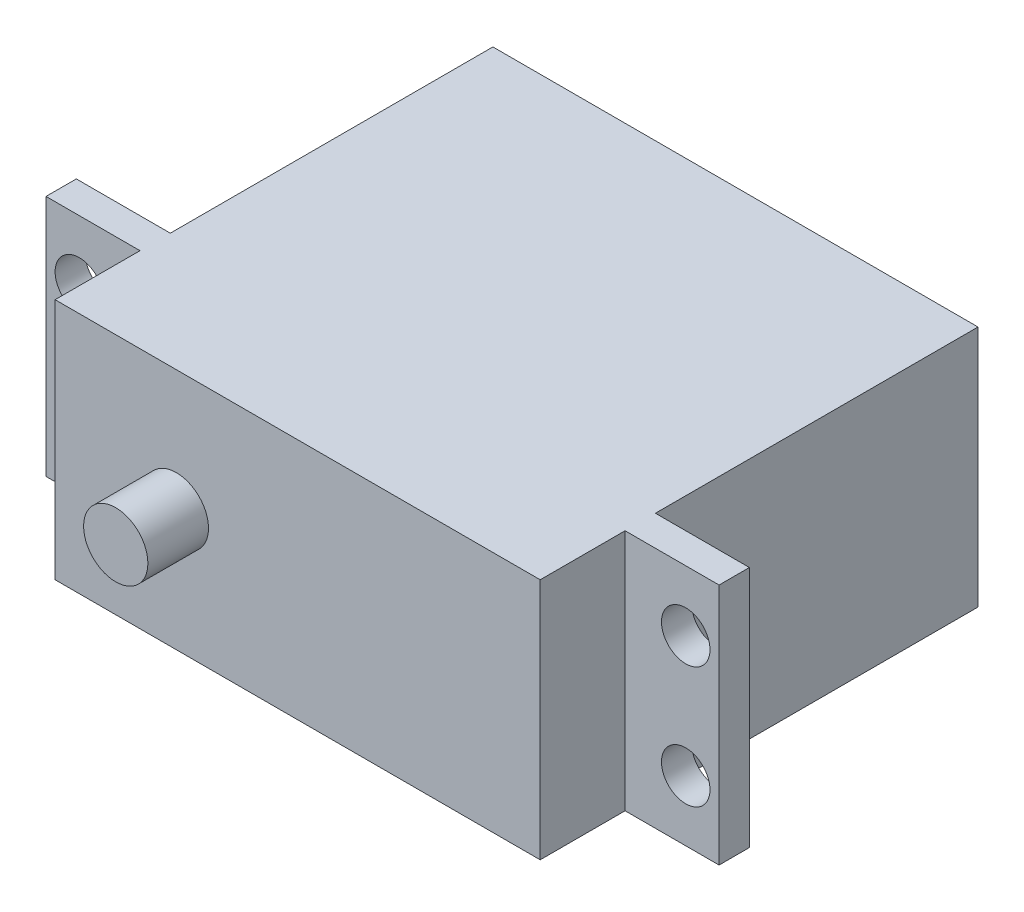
ISO-10303-21;
HEADER;
FILE_DESCRIPTION(('STEP AP214'),'2;1');
FILE_NAME('part.step','',(''),(''),'','','');
FILE_SCHEMA(('AUTOMOTIVE_DESIGN { 1 0 10303 214 1 1 1 1 }'));
ENDSEC;
DATA;
#1=APPLICATION_CONTEXT('core data for automotive mechanical design processes');
#2=APPLICATION_PROTOCOL_DEFINITION('international standard','automotive_design',2000,#1);
#3=PRODUCT_CONTEXT('',#1,'mechanical');
#4=PRODUCT('Part','Part','',(#3));
#5=PRODUCT_RELATED_PRODUCT_CATEGORY('part','',(#4));
#6=PRODUCT_DEFINITION_FORMATION('','',#4);
#7=PRODUCT_DEFINITION_CONTEXT('part definition',#1,'design');
#8=PRODUCT_DEFINITION('design','',#6,#7);
#9=PRODUCT_DEFINITION_SHAPE('','',#8);
#10=(LENGTH_UNIT() NAMED_UNIT(*) SI_UNIT(.MILLI.,.METRE.));
#11=(NAMED_UNIT(*) PLANE_ANGLE_UNIT() SI_UNIT($,.RADIAN.));
#12=(NAMED_UNIT(*) SI_UNIT($,.STERADIAN.) SOLID_ANGLE_UNIT());
#13=UNCERTAINTY_MEASURE_WITH_UNIT(LENGTH_MEASURE(1.E-05),#10,'distance_accuracy_value','');
#14=(GEOMETRIC_REPRESENTATION_CONTEXT(3) GLOBAL_UNCERTAINTY_ASSIGNED_CONTEXT((#13)) GLOBAL_UNIT_ASSIGNED_CONTEXT((#10,
#11,#12)) REPRESENTATION_CONTEXT('',''));
#15=CARTESIAN_POINT('',(0.,0.,0.));
#16=DIRECTION('',(0.,0.,1.));
#17=DIRECTION('',(1.,0.,0.));
#18=AXIS2_PLACEMENT_3D('',#15,#16,#17);
#19=CARTESIAN_POINT('',(0.,0.,36.1));
#20=DIRECTION('',(0.,0.,-1.));
#21=DIRECTION('',(-1.,0.,0.));
#22=AXIS2_PLACEMENT_3D('',#19,#20,#21);
#23=PLANE('',#22);
#24=DIRECTION('',(0.,-1.,0.));
#25=VECTOR('',#24,1.);
#26=CARTESIAN_POINT('',(0.,0.,36.1));
#27=LINE('',#26,#25);
#28=CARTESIAN_POINT('',(0.,20.,36.1));
#29=VERTEX_POINT('',#28);
#30=CARTESIAN_POINT('',(0.,0.,36.1));
#31=VERTEX_POINT('',#30);
#32=EDGE_CURVE('E187',#29,#31,#27,.T.);
#33=ORIENTED_EDGE('',*,*,#32,.T.);
#34=DIRECTION('',(1.,0.,0.));
#35=VECTOR('',#34,1.);
#36=CARTESIAN_POINT('',(0.,0.,36.1));
#37=LINE('',#36,#35);
#38=CARTESIAN_POINT('',(40.,0.,36.1));
#39=VERTEX_POINT('',#38);
#40=EDGE_CURVE('E190',#31,#39,#37,.T.);
#41=ORIENTED_EDGE('',*,*,#40,.T.);
#42=DIRECTION('',(0.,1.,0.));
#43=VECTOR('',#42,1.);
#44=CARTESIAN_POINT('',(40.,0.,36.1));
#45=LINE('',#44,#43);
#46=CARTESIAN_POINT('',(40.,20.,36.1));
#47=VERTEX_POINT('',#46);
#48=EDGE_CURVE('E193',#39,#47,#45,.T.);
#49=ORIENTED_EDGE('',*,*,#48,.T.);
#50=DIRECTION('',(-1.,0.,0.));
#51=VECTOR('',#50,1.);
#52=CARTESIAN_POINT('',(0.,20.,36.1));
#53=LINE('',#52,#51);
#54=EDGE_CURVE('E195',#47,#29,#53,.T.);
#55=ORIENTED_EDGE('',*,*,#54,.T.);
#56=EDGE_LOOP('',(#33,#41,#49,#55));
#57=FACE_BOUND('',#56,.T.);
#58=CARTESIAN_POINT('',(10.,10.,36.1));
#59=DIRECTION('',(0.,0.,-1.));
#60=DIRECTION('',(-1.,0.,0.));
#61=AXIS2_PLACEMENT_3D('',#58,#59,#60);
#62=CIRCLE('',#61,2.65);
#63=CARTESIAN_POINT('',(7.35,10.,36.1));
#64=VERTEX_POINT('',#63);
#65=EDGE_CURVE('E11',#64,#64,#62,.F.);
#66=ORIENTED_EDGE('',*,*,#65,.F.);
#67=EDGE_LOOP('',(#66));
#68=FACE_BOUND('',#67,.T.);
#69=ADVANCED_FACE('F35',(#57,#68),#23,.F.);
#70=CARTESIAN_POINT('',(0.,0.,36.1));
#71=DIRECTION('',(1.,0.,0.));
#72=DIRECTION('',(0.,0.,-1.));
#73=AXIS2_PLACEMENT_3D('',#70,#71,#72);
#74=PLANE('',#73);
#75=DIRECTION('',(0.,0.,-1.));
#76=VECTOR('',#75,1.);
#77=CARTESIAN_POINT('',(0.,20.,36.1));
#78=LINE('',#77,#76);
#79=CARTESIAN_POINT('',(0.,20.,29.1));
#80=VERTEX_POINT('',#79);
#81=EDGE_CURVE('E208',#29,#80,#78,.T.);
#82=ORIENTED_EDGE('',*,*,#81,.T.);
#83=DIRECTION('',(0.,-1.,0.));
#84=VECTOR('',#83,1.);
#85=CARTESIAN_POINT('',(0.,0.,29.1));
#86=LINE('',#85,#84);
#87=CARTESIAN_POINT('',(0.,0.,29.1));
#88=VERTEX_POINT('',#87);
#89=EDGE_CURVE('E183',#80,#88,#86,.T.);
#90=ORIENTED_EDGE('',*,*,#89,.T.);
#91=DIRECTION('',(0.,0.,-1.));
#92=VECTOR('',#91,1.);
#93=CARTESIAN_POINT('',(0.,0.,36.1));
#94=LINE('',#93,#92);
#95=EDGE_CURVE('E43',#31,#88,#94,.T.);
#96=ORIENTED_EDGE('',*,*,#95,.F.);
#97=ORIENTED_EDGE('',*,*,#32,.F.);
#98=EDGE_LOOP('',(#82,#90,#96,#97));
#99=FACE_BOUND('',#98,.T.);
#100=ADVANCED_FACE('F264',(#99),#74,.F.);
#101=CARTESIAN_POINT('',(40.,0.,36.1));
#102=DIRECTION('',(-1.,0.,0.));
#103=DIRECTION('',(0.,0.,1.));
#104=AXIS2_PLACEMENT_3D('',#101,#102,#103);
#105=PLANE('',#104);
#106=DIRECTION('',(0.,0.,-1.));
#107=VECTOR('',#106,1.);
#108=CARTESIAN_POINT('',(40.,0.,36.1));
#109=LINE('',#108,#107);
#110=CARTESIAN_POINT('',(40.,0.,29.1));
#111=VERTEX_POINT('',#110);
#112=EDGE_CURVE('E58',#39,#111,#109,.T.);
#113=ORIENTED_EDGE('',*,*,#112,.T.);
#114=DIRECTION('',(0.,1.,0.));
#115=VECTOR('',#114,1.);
#116=CARTESIAN_POINT('',(40.,0.,29.1));
#117=LINE('',#116,#115);
#118=CARTESIAN_POINT('',(40.,20.,29.1));
#119=VERTEX_POINT('',#118);
#120=EDGE_CURVE('E131',#111,#119,#117,.T.);
#121=ORIENTED_EDGE('',*,*,#120,.T.);
#122=DIRECTION('',(0.,0.,-1.));
#123=VECTOR('',#122,1.);
#124=CARTESIAN_POINT('',(40.,20.,36.1));
#125=LINE('',#124,#123);
#126=EDGE_CURVE('E212',#47,#119,#125,.T.);
#127=ORIENTED_EDGE('',*,*,#126,.F.);
#128=ORIENTED_EDGE('',*,*,#48,.F.);
#129=EDGE_LOOP('',(#113,#121,#127,#128));
#130=FACE_BOUND('',#129,.T.);
#131=ADVANCED_FACE('F269',(#130),#105,.F.);
#132=CARTESIAN_POINT('',(0.,0.,26.6));
#133=VERTEX_POINT('',#132);
#134=CARTESIAN_POINT('',(0.,0.,0.));
#135=VERTEX_POINT('',#134);
#136=EDGE_CURVE('E217',#133,#135,#94,.T.);
#137=ORIENTED_EDGE('',*,*,#136,.F.);
#138=DIRECTION('',(0.,1.,0.));
#139=VECTOR('',#138,1.);
#140=CARTESIAN_POINT('',(0.,0.,26.6));
#141=LINE('',#140,#139);
#142=CARTESIAN_POINT('',(0.,20.,26.6));
#143=VERTEX_POINT('',#142);
#144=EDGE_CURVE('E179',#133,#143,#141,.T.);
#145=ORIENTED_EDGE('',*,*,#144,.T.);
#146=CARTESIAN_POINT('',(0.,20.,0.));
#147=VERTEX_POINT('',#146);
#148=EDGE_CURVE('E197',#143,#147,#78,.T.);
#149=ORIENTED_EDGE('',*,*,#148,.T.);
#150=DIRECTION('',(0.,-1.,0.));
#151=VECTOR('',#150,1.);
#152=CARTESIAN_POINT('',(0.,0.,0.));
#153=LINE('',#152,#151);
#154=EDGE_CURVE('E186',#147,#135,#153,.T.);
#155=ORIENTED_EDGE('',*,*,#154,.T.);
#156=EDGE_LOOP('',(#137,#145,#149,#155));
#157=FACE_BOUND('',#156,.T.);
#158=ADVANCED_FACE('F37',(#157),#74,.F.);
#159=CARTESIAN_POINT('',(0.,0.,36.1));
#160=DIRECTION('',(0.,1.,0.));
#161=DIRECTION('',(0.,0.,1.));
#162=AXIS2_PLACEMENT_3D('',#159,#160,#161);
#163=PLANE('',#162);
#164=CARTESIAN_POINT('',(40.,0.,26.6));
#165=VERTEX_POINT('',#164);
#166=CARTESIAN_POINT('',(40.,0.,0.));
#167=VERTEX_POINT('',#166);
#168=EDGE_CURVE('E215',#165,#167,#109,.T.);
#169=ORIENTED_EDGE('',*,*,#168,.F.);
#170=DIRECTION('',(1.,0.,0.));
#171=VECTOR('',#170,1.);
#172=CARTESIAN_POINT('',(-7.75,0.,26.6));
#173=LINE('',#172,#171);
#174=CARTESIAN_POINT('',(47.75,0.,26.6));
#175=VERTEX_POINT('',#174);
#176=EDGE_CURVE('E139',#165,#175,#173,.T.);
#177=ORIENTED_EDGE('',*,*,#176,.T.);
#178=DIRECTION('',(0.,0.,-1.));
#179=VECTOR('',#178,1.);
#180=CARTESIAN_POINT('',(47.75,0.,29.1));
#181=LINE('',#180,#179);
#182=CARTESIAN_POINT('',(47.75,0.,29.1));
#183=VERTEX_POINT('',#182);
#184=EDGE_CURVE('E136',#183,#175,#181,.T.);
#185=ORIENTED_EDGE('',*,*,#184,.F.);
#186=DIRECTION('',(1.,0.,0.));
#187=VECTOR('',#186,1.);
#188=CARTESIAN_POINT('',(-7.75,0.,29.1));
#189=LINE('',#188,#187);
#190=EDGE_CURVE('E125',#111,#183,#189,.T.);
#191=ORIENTED_EDGE('',*,*,#190,.F.);
#192=ORIENTED_EDGE('',*,*,#112,.F.);
#193=ORIENTED_EDGE('',*,*,#40,.F.);
#194=ORIENTED_EDGE('',*,*,#95,.T.);
#195=CARTESIAN_POINT('',(-7.75,0.,29.1));
#196=VERTEX_POINT('',#195);
#197=EDGE_CURVE('E132',#196,#88,#189,.T.);
#198=ORIENTED_EDGE('',*,*,#197,.F.);
#199=DIRECTION('',(0.,0.,-1.));
#200=VECTOR('',#199,1.);
#201=CARTESIAN_POINT('',(-7.75,0.,29.1));
#202=LINE('',#201,#200);
#203=CARTESIAN_POINT('',(-7.75,0.,26.6));
#204=VERTEX_POINT('',#203);
#205=EDGE_CURVE('E161',#196,#204,#202,.T.);
#206=ORIENTED_EDGE('',*,*,#205,.T.);
#207=EDGE_CURVE('E50',#204,#133,#173,.T.);
#208=ORIENTED_EDGE('',*,*,#207,.T.);
#209=ORIENTED_EDGE('',*,*,#136,.T.);
#210=DIRECTION('',(1.,0.,0.));
#211=VECTOR('',#210,1.);
#212=CARTESIAN_POINT('',(0.,0.,0.));
#213=LINE('',#212,#211);
#214=EDGE_CURVE('E200',#135,#167,#213,.T.);
#215=ORIENTED_EDGE('',*,*,#214,.T.);
#216=EDGE_LOOP('',(#169,#177,#185,#191,#192,#193,#194,#198,#206,#208,#209,#215));
#217=FACE_BOUND('',#216,.T.);
#218=ADVANCED_FACE('F137',(#217),#163,.F.);
#219=CARTESIAN_POINT('',(40.,20.,26.6));
#220=VERTEX_POINT('',#219);
#221=CARTESIAN_POINT('',(40.,20.,0.));
#222=VERTEX_POINT('',#221);
#223=EDGE_CURVE('E211',#220,#222,#125,.T.);
#224=ORIENTED_EDGE('',*,*,#223,.F.);
#225=DIRECTION('',(0.,-1.,0.));
#226=VECTOR('',#225,1.);
#227=CARTESIAN_POINT('',(40.,0.,26.6));
#228=LINE('',#227,#226);
#229=EDGE_CURVE('E171',#220,#165,#228,.T.);
#230=ORIENTED_EDGE('',*,*,#229,.T.);
#231=ORIENTED_EDGE('',*,*,#168,.T.);
#232=DIRECTION('',(0.,1.,0.));
#233=VECTOR('',#232,1.);
#234=CARTESIAN_POINT('',(40.,0.,0.));
#235=LINE('',#234,#233);
#236=EDGE_CURVE('E203',#167,#222,#235,.T.);
#237=ORIENTED_EDGE('',*,*,#236,.T.);
#238=EDGE_LOOP('',(#224,#230,#231,#237));
#239=FACE_BOUND('',#238,.T.);
#240=ADVANCED_FACE('F280',(#239),#105,.F.);
#241=CARTESIAN_POINT('',(0.,20.,36.1));
#242=DIRECTION('',(0.,-1.,0.));
#243=DIRECTION('',(0.,0.,-1.));
#244=AXIS2_PLACEMENT_3D('',#241,#242,#243);
#245=PLANE('',#244);
#246=ORIENTED_EDGE('',*,*,#148,.F.);
#247=DIRECTION('',(1.,0.,0.));
#248=VECTOR('',#247,1.);
#249=CARTESIAN_POINT('',(-7.75,20.,26.6));
#250=LINE('',#249,#248);
#251=CARTESIAN_POINT('',(-7.75,20.,26.6));
#252=VERTEX_POINT('',#251);
#253=EDGE_CURVE('E173',#252,#143,#250,.T.);
#254=ORIENTED_EDGE('',*,*,#253,.F.);
#255=DIRECTION('',(0.,0.,1.));
#256=VECTOR('',#255,1.);
#257=CARTESIAN_POINT('',(-7.75,20.,29.1));
#258=LINE('',#257,#256);
#259=CARTESIAN_POINT('',(-7.75,20.,29.1));
#260=VERTEX_POINT('',#259);
#261=EDGE_CURVE('E133',#252,#260,#258,.T.);
#262=ORIENTED_EDGE('',*,*,#261,.T.);
#263=DIRECTION('',(1.,0.,0.));
#264=VECTOR('',#263,1.);
#265=CARTESIAN_POINT('',(-7.75,20.,29.1));
#266=LINE('',#265,#264);
#267=EDGE_CURVE('E168',#260,#80,#266,.T.);
#268=ORIENTED_EDGE('',*,*,#267,.T.);
#269=ORIENTED_EDGE('',*,*,#81,.F.);
#270=ORIENTED_EDGE('',*,*,#54,.F.);
#271=ORIENTED_EDGE('',*,*,#126,.T.);
#272=CARTESIAN_POINT('',(47.75,20.,29.1));
#273=VERTEX_POINT('',#272);
#274=EDGE_CURVE('E172',#119,#273,#266,.T.);
#275=ORIENTED_EDGE('',*,*,#274,.T.);
#276=DIRECTION('',(0.,0.,1.));
#277=VECTOR('',#276,1.);
#278=CARTESIAN_POINT('',(47.75,20.,29.1));
#279=LINE('',#278,#277);
#280=CARTESIAN_POINT('',(47.75,20.,26.6));
#281=VERTEX_POINT('',#280);
#282=EDGE_CURVE('E148',#281,#273,#279,.T.);
#283=ORIENTED_EDGE('',*,*,#282,.F.);
#284=EDGE_CURVE('E175',#220,#281,#250,.T.);
#285=ORIENTED_EDGE('',*,*,#284,.F.);
#286=ORIENTED_EDGE('',*,*,#223,.T.);
#287=DIRECTION('',(-1.,0.,0.));
#288=VECTOR('',#287,1.);
#289=CARTESIAN_POINT('',(0.,20.,0.));
#290=LINE('',#289,#288);
#291=EDGE_CURVE('E191',#222,#147,#290,.T.);
#292=ORIENTED_EDGE('',*,*,#291,.T.);
#293=EDGE_LOOP('',(#246,#254,#262,#268,#269,#270,#271,#275,#283,#285,#286,#292));
#294=FACE_BOUND('',#293,.T.);
#295=ADVANCED_FACE('F276',(#294),#245,.F.);
#296=CARTESIAN_POINT('',(0.,0.,0.));
#297=DIRECTION('',(0.,0.,-1.));
#298=DIRECTION('',(-1.,0.,0.));
#299=AXIS2_PLACEMENT_3D('',#296,#297,#298);
#300=PLANE('',#299);
#301=ORIENTED_EDGE('',*,*,#154,.F.);
#302=ORIENTED_EDGE('',*,*,#291,.F.);
#303=ORIENTED_EDGE('',*,*,#236,.F.);
#304=ORIENTED_EDGE('',*,*,#214,.F.);
#305=EDGE_LOOP('',(#301,#302,#303,#304));
#306=FACE_BOUND('',#305,.T.);
#307=ADVANCED_FACE('F273',(#306),#300,.T.);
#308=CARTESIAN_POINT('',(47.75,0.,0.));
#309=DIRECTION('',(1.,0.,0.));
#310=DIRECTION('',(0.,0.,-1.));
#311=AXIS2_PLACEMENT_3D('',#308,#309,#310);
#312=PLANE('',#311);
#313=DIRECTION('',(0.,-1.,0.));
#314=VECTOR('',#313,1.);
#315=CARTESIAN_POINT('',(47.75,20.,29.1));
#316=LINE('',#315,#314);
#317=EDGE_CURVE('E130',#273,#183,#316,.T.);
#318=ORIENTED_EDGE('',*,*,#317,.T.);
#319=ORIENTED_EDGE('',*,*,#184,.T.);
#320=DIRECTION('',(0.,1.,0.));
#321=VECTOR('',#320,1.);
#322=CARTESIAN_POINT('',(47.75,20.,26.6));
#323=LINE('',#322,#321);
#324=EDGE_CURVE('E143',#175,#281,#323,.T.);
#325=ORIENTED_EDGE('',*,*,#324,.T.);
#326=ORIENTED_EDGE('',*,*,#282,.T.);
#327=EDGE_LOOP('',(#318,#319,#325,#326));
#328=FACE_BOUND('',#327,.T.);
#329=ADVANCED_FACE('F146',(#328),#312,.T.);
#330=CARTESIAN_POINT('',(-7.75,20.,26.6));
#331=DIRECTION('',(0.,0.,-1.));
#332=DIRECTION('',(0.,1.,0.));
#333=AXIS2_PLACEMENT_3D('',#330,#331,#332);
#334=PLANE('',#333);
#335=CARTESIAN_POINT('',(45.,5.,26.6));
#336=DIRECTION('',(0.,0.,-1.));
#337=DIRECTION('',(0.,1.,0.));
#338=AXIS2_PLACEMENT_3D('',#335,#336,#337);
#339=CIRCLE('',#338,2.);
#340=CARTESIAN_POINT('',(45.,7.,26.6));
#341=VERTEX_POINT('',#340);
#342=EDGE_CURVE('E241',#341,#341,#339,.T.);
#343=ORIENTED_EDGE('',*,*,#342,.F.);
#344=EDGE_LOOP('',(#343));
#345=FACE_BOUND('',#344,.T.);
#346=CARTESIAN_POINT('',(45.,15.,26.6));
#347=DIRECTION('',(0.,0.,-1.));
#348=DIRECTION('',(0.,1.,0.));
#349=AXIS2_PLACEMENT_3D('',#346,#347,#348);
#350=CIRCLE('',#349,2.);
#351=CARTESIAN_POINT('',(45.,17.,26.6));
#352=VERTEX_POINT('',#351);
#353=EDGE_CURVE('E149',#352,#352,#350,.T.);
#354=ORIENTED_EDGE('',*,*,#353,.F.);
#355=EDGE_LOOP('',(#354));
#356=FACE_BOUND('',#355,.T.);
#357=ORIENTED_EDGE('',*,*,#229,.F.);
#358=ORIENTED_EDGE('',*,*,#284,.T.);
#359=ORIENTED_EDGE('',*,*,#324,.F.);
#360=ORIENTED_EDGE('',*,*,#176,.F.);
#361=EDGE_LOOP('',(#357,#358,#359,#360));
#362=FACE_BOUND('',#361,.T.);
#363=ADVANCED_FACE('F250',(#345,#356,#362),#334,.T.);
#364=CARTESIAN_POINT('',(-7.75,20.,29.1));
#365=DIRECTION('',(0.,0.,1.));
#366=DIRECTION('',(0.,-1.,0.));
#367=AXIS2_PLACEMENT_3D('',#364,#365,#366);
#368=PLANE('',#367);
#369=CARTESIAN_POINT('',(45.,5.,29.1));
#370=DIRECTION('',(0.,0.,1.));
#371=DIRECTION('',(1.,0.,0.));
#372=AXIS2_PLACEMENT_3D('',#369,#370,#371);
#373=CIRCLE('',#372,2.);
#374=CARTESIAN_POINT('',(47.,5.,29.1));
#375=VERTEX_POINT('',#374);
#376=EDGE_CURVE('E222',#375,#375,#373,.T.);
#377=ORIENTED_EDGE('',*,*,#376,.F.);
#378=EDGE_LOOP('',(#377));
#379=FACE_BOUND('',#378,.T.);
#380=CARTESIAN_POINT('',(45.,15.,29.1));
#381=DIRECTION('',(0.,0.,1.));
#382=DIRECTION('',(1.,0.,0.));
#383=AXIS2_PLACEMENT_3D('',#380,#381,#382);
#384=CIRCLE('',#383,2.);
#385=CARTESIAN_POINT('',(47.,15.,29.1));
#386=VERTEX_POINT('',#385);
#387=EDGE_CURVE('E152',#386,#386,#384,.T.);
#388=ORIENTED_EDGE('',*,*,#387,.F.);
#389=EDGE_LOOP('',(#388));
#390=FACE_BOUND('',#389,.T.);
#391=ORIENTED_EDGE('',*,*,#120,.F.);
#392=ORIENTED_EDGE('',*,*,#190,.T.);
#393=ORIENTED_EDGE('',*,*,#317,.F.);
#394=ORIENTED_EDGE('',*,*,#274,.F.);
#395=EDGE_LOOP('',(#391,#392,#393,#394));
#396=FACE_BOUND('',#395,.T.);
#397=ADVANCED_FACE('F127',(#379,#390,#396),#368,.T.);
#398=CARTESIAN_POINT('',(-5.,5.,29.1));
#399=DIRECTION('',(0.,0.,1.));
#400=DIRECTION('',(1.,0.,0.));
#401=AXIS2_PLACEMENT_3D('',#398,#399,#400);
#402=CIRCLE('',#401,2.);
#403=CARTESIAN_POINT('',(-3.,5.,29.1));
#404=VERTEX_POINT('',#403);
#405=EDGE_CURVE('E226',#404,#404,#402,.T.);
#406=ORIENTED_EDGE('',*,*,#405,.F.);
#407=EDGE_LOOP('',(#406));
#408=FACE_BOUND('',#407,.T.);
#409=CARTESIAN_POINT('',(-5.,15.,29.1));
#410=DIRECTION('',(0.,0.,1.));
#411=DIRECTION('',(1.,0.,0.));
#412=AXIS2_PLACEMENT_3D('',#409,#410,#411);
#413=CIRCLE('',#412,2.);
#414=CARTESIAN_POINT('',(-3.,15.,29.1));
#415=VERTEX_POINT('',#414);
#416=EDGE_CURVE('E223',#415,#415,#413,.T.);
#417=ORIENTED_EDGE('',*,*,#416,.F.);
#418=EDGE_LOOP('',(#417));
#419=FACE_BOUND('',#418,.T.);
#420=ORIENTED_EDGE('',*,*,#89,.F.);
#421=ORIENTED_EDGE('',*,*,#267,.F.);
#422=DIRECTION('',(0.,-1.,0.));
#423=VECTOR('',#422,1.);
#424=CARTESIAN_POINT('',(-7.75,20.,29.1));
#425=LINE('',#424,#423);
#426=EDGE_CURVE('E158',#260,#196,#425,.T.);
#427=ORIENTED_EDGE('',*,*,#426,.T.);
#428=ORIENTED_EDGE('',*,*,#197,.T.);
#429=EDGE_LOOP('',(#420,#421,#427,#428));
#430=FACE_BOUND('',#429,.T.);
#431=ADVANCED_FACE('F249',(#408,#419,#430),#368,.T.);
#432=CARTESIAN_POINT('',(-5.,5.,26.6));
#433=DIRECTION('',(0.,0.,-1.));
#434=DIRECTION('',(0.,1.,0.));
#435=AXIS2_PLACEMENT_3D('',#432,#433,#434);
#436=CIRCLE('',#435,2.);
#437=CARTESIAN_POINT('',(-5.,7.,26.6));
#438=VERTEX_POINT('',#437);
#439=EDGE_CURVE('E224',#438,#438,#436,.T.);
#440=ORIENTED_EDGE('',*,*,#439,.F.);
#441=EDGE_LOOP('',(#440));
#442=FACE_BOUND('',#441,.T.);
#443=CARTESIAN_POINT('',(-5.,15.,26.6));
#444=DIRECTION('',(0.,0.,-1.));
#445=DIRECTION('',(0.,1.,0.));
#446=AXIS2_PLACEMENT_3D('',#443,#444,#445);
#447=CIRCLE('',#446,2.);
#448=CARTESIAN_POINT('',(-5.,17.,26.6));
#449=VERTEX_POINT('',#448);
#450=EDGE_CURVE('E220',#449,#449,#447,.T.);
#451=ORIENTED_EDGE('',*,*,#450,.F.);
#452=EDGE_LOOP('',(#451));
#453=FACE_BOUND('',#452,.T.);
#454=ORIENTED_EDGE('',*,*,#144,.F.);
#455=ORIENTED_EDGE('',*,*,#207,.F.);
#456=DIRECTION('',(0.,1.,0.));
#457=VECTOR('',#456,1.);
#458=CARTESIAN_POINT('',(-7.75,20.,26.6));
#459=LINE('',#458,#457);
#460=EDGE_CURVE('E163',#204,#252,#459,.T.);
#461=ORIENTED_EDGE('',*,*,#460,.T.);
#462=ORIENTED_EDGE('',*,*,#253,.T.);
#463=EDGE_LOOP('',(#454,#455,#461,#462));
#464=FACE_BOUND('',#463,.T.);
#465=ADVANCED_FACE('F257',(#442,#453,#464),#334,.T.);
#466=CARTESIAN_POINT('',(-7.75,0.,0.));
#467=DIRECTION('',(1.,0.,0.));
#468=DIRECTION('',(0.,0.,-1.));
#469=AXIS2_PLACEMENT_3D('',#466,#467,#468);
#470=PLANE('',#469);
#471=ORIENTED_EDGE('',*,*,#426,.F.);
#472=ORIENTED_EDGE('',*,*,#261,.F.);
#473=ORIENTED_EDGE('',*,*,#460,.F.);
#474=ORIENTED_EDGE('',*,*,#205,.F.);
#475=EDGE_LOOP('',(#471,#472,#473,#474));
#476=FACE_BOUND('',#475,.T.);
#477=ADVANCED_FACE('F312',(#476),#470,.F.);
#478=CARTESIAN_POINT('',(45.,15.,21.6));
#479=DIRECTION('',(0.,0.,1.));
#480=DIRECTION('',(1.,0.,0.));
#481=AXIS2_PLACEMENT_3D('',#478,#479,#480);
#482=CYLINDRICAL_SURFACE('',#481,2.);
#483=ORIENTED_EDGE('',*,*,#353,.T.);
#484=EDGE_LOOP('',(#483));
#485=FACE_BOUND('',#484,.T.);
#486=ORIENTED_EDGE('',*,*,#387,.T.);
#487=EDGE_LOOP('',(#486));
#488=FACE_BOUND('',#487,.T.);
#489=ADVANCED_FACE('F246',(#485,#488),#482,.F.);
#490=CARTESIAN_POINT('',(45.,5.,21.6));
#491=DIRECTION('',(0.,0.,1.));
#492=DIRECTION('',(1.,0.,0.));
#493=AXIS2_PLACEMENT_3D('',#490,#491,#492);
#494=CYLINDRICAL_SURFACE('',#493,2.);
#495=ORIENTED_EDGE('',*,*,#342,.T.);
#496=EDGE_LOOP('',(#495));
#497=FACE_BOUND('',#496,.T.);
#498=ORIENTED_EDGE('',*,*,#376,.T.);
#499=EDGE_LOOP('',(#498));
#500=FACE_BOUND('',#499,.T.);
#501=ADVANCED_FACE('F326',(#497,#500),#494,.F.);
#502=CARTESIAN_POINT('',(-5.,15.,21.6));
#503=DIRECTION('',(0.,0.,1.));
#504=DIRECTION('',(1.,0.,0.));
#505=AXIS2_PLACEMENT_3D('',#502,#503,#504);
#506=CYLINDRICAL_SURFACE('',#505,2.);
#507=ORIENTED_EDGE('',*,*,#450,.T.);
#508=EDGE_LOOP('',(#507));
#509=FACE_BOUND('',#508,.T.);
#510=ORIENTED_EDGE('',*,*,#416,.T.);
#511=EDGE_LOOP('',(#510));
#512=FACE_BOUND('',#511,.T.);
#513=ADVANCED_FACE('F330',(#509,#512),#506,.F.);
#514=CARTESIAN_POINT('',(-5.,5.,21.6));
#515=DIRECTION('',(0.,0.,1.));
#516=DIRECTION('',(1.,0.,0.));
#517=AXIS2_PLACEMENT_3D('',#514,#515,#516);
#518=CYLINDRICAL_SURFACE('',#517,2.);
#519=ORIENTED_EDGE('',*,*,#439,.T.);
#520=EDGE_LOOP('',(#519));
#521=FACE_BOUND('',#520,.T.);
#522=ORIENTED_EDGE('',*,*,#405,.T.);
#523=EDGE_LOOP('',(#522));
#524=FACE_BOUND('',#523,.T.);
#525=ADVANCED_FACE('F334',(#521,#524),#518,.F.);
#526=CARTESIAN_POINT('',(10.,10.,41.1));
#527=DIRECTION('',(0.,0.,-1.));
#528=DIRECTION('',(-1.,0.,0.));
#529=AXIS2_PLACEMENT_3D('',#526,#527,#528);
#530=CYLINDRICAL_SURFACE('',#529,2.65);
#531=CARTESIAN_POINT('',(10.,10.,41.1));
#532=DIRECTION('',(0.,0.,1.));
#533=DIRECTION('',(1.,0.,0.));
#534=AXIS2_PLACEMENT_3D('',#531,#532,#533);
#535=CIRCLE('',#534,2.65);
#536=CARTESIAN_POINT('',(12.65,10.,41.1));
#537=VERTEX_POINT('',#536);
#538=EDGE_CURVE('E232',#537,#537,#535,.T.);
#539=ORIENTED_EDGE('',*,*,#538,.F.);
#540=EDGE_LOOP('',(#539));
#541=FACE_BOUND('',#540,.T.);
#542=ORIENTED_EDGE('',*,*,#65,.T.);
#543=EDGE_LOOP('',(#542));
#544=FACE_BOUND('',#543,.T.);
#545=ADVANCED_FACE('F338',(#541,#544),#530,.T.);
#546=CARTESIAN_POINT('',(10.,10.,41.1));
#547=DIRECTION('',(0.,0.,1.));
#548=DIRECTION('',(1.,0.,0.));
#549=AXIS2_PLACEMENT_3D('',#546,#547,#548);
#550=PLANE('',#549);
#551=ORIENTED_EDGE('',*,*,#538,.T.);
#552=EDGE_LOOP('',(#551));
#553=FACE_BOUND('',#552,.T.);
#554=ADVANCED_FACE('F341',(#553),#550,.T.);
#555=CLOSED_SHELL('',(#69,#100,#131,#158,#218,#240,#295,#307,#329,#363,#397,#431,#465,#477,#489,
#501,#513,#525,#545,#554));
#556=MANIFOLD_SOLID_BREP('B2',#555);
#557=ADVANCED_BREP_SHAPE_REPRESENTATION('',(#18,#556),#14);
#558=SHAPE_DEFINITION_REPRESENTATION(#9,#557);
ENDSEC;
END-ISO-10303-21;
